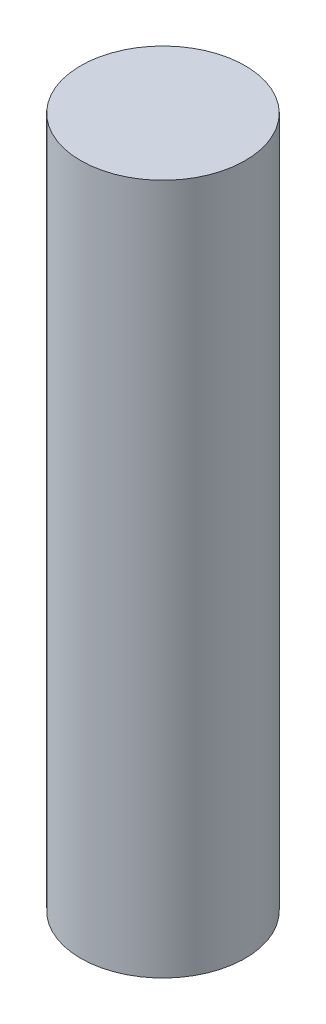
from build123d import *

# Parameters (mm, degrees)
SKETCH1_R           = 6.35
BOSS_EXTRUDE1_DEPTH = 53.34


with BuildPart() as part:
    # Sketch1 → Boss-Extrude1 (new body)
    with BuildSketch(Plane(origin=(0, 0, 0), x_dir=(1, 0, 0), z_dir=(0, 1, 0))):
        with Locations(Location((0, 0, 0), (0, 0, 270))):
            Circle(SKETCH1_R)
    extrude(amount=BOSS_EXTRUDE1_DEPTH)


solid = part.part
